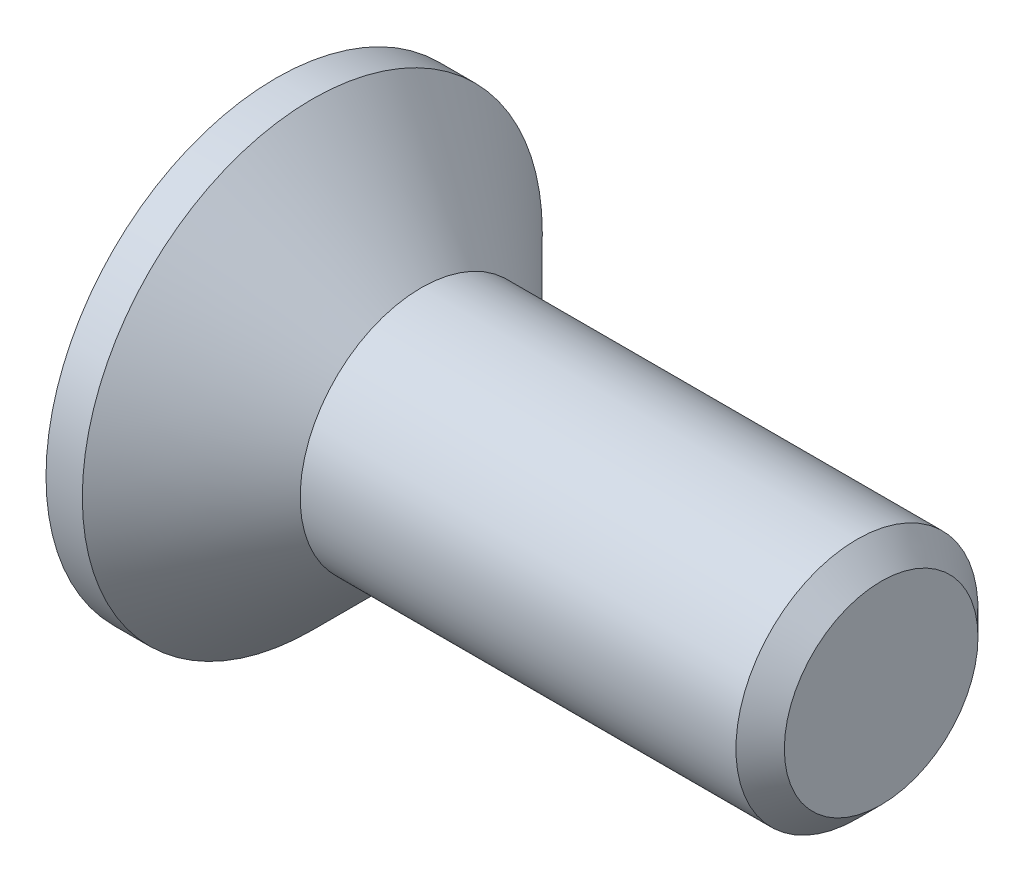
from build123d import *

# Parameters (mm, degrees)
CHAMFER1_SIZE      = 0.2
CUT_EXTRUDE1_DEPTH = 0.95


with BuildPart() as part:
    # Sketch1 → Revolve1 (revolve)
    with BuildSketch(Plane.XY, mode=Mode.PRIVATE) as revolve1_sk:
        Polygon((-1.2, 1.9), (-1.2, 0), (3.8, 0), (3.8, 1), (0, 1), (-0.9, 1.9), align=None)
    revolve(revolve1_sk.sketch.rotate(Axis((-1.2, 0, 0), (1, 0, 0)), 180), axis=Axis((-1.2, 0, 0), (1, 0, 0)))

    # Chamfer1
    chamfer1_edges = [part.edges().sort_by_distance(p)[0] for p in [
        (3.8, 1, 0),
    ]]
    chamfer(chamfer1_edges, length=CHAMFER1_SIZE)

    # Sketch2 → Cut-Extrude1 (cut)
    with BuildSketch(Plane.ZY.offset(1.2)):
        Polygon((-0.3, 1.175), (0.3, 1.175), (0.3, 0.3), (1.175, 0.3), (1.175, -0.3), (0.3, -0.3), (0.3, -1.175), (-0.3, -1.175), (-0.3, -0.3), (-1.175, -0.3), (-1.175, 0.3), (-0.3, 0.3), align=None)
    extrude(amount=-CUT_EXTRUDE1_DEPTH, mode=Mode.SUBTRACT)


solid = part.part
